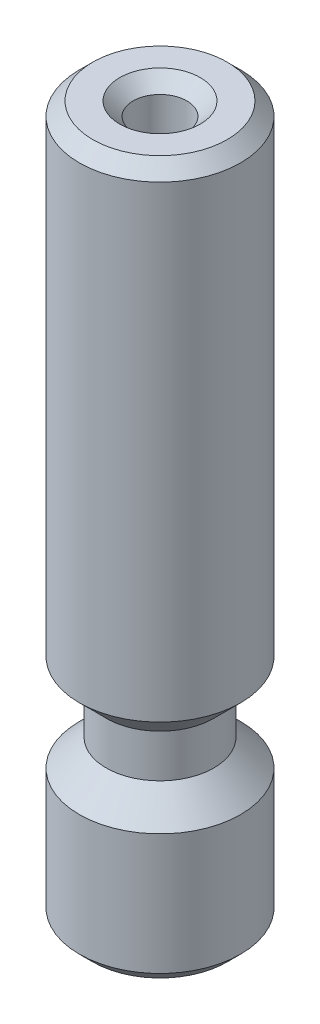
from build123d import *

# Parameters (mm, degrees)
SKETCH1_R           = 3
BOSS_EXTRUDE1_DEPTH = 26.5
SKETCH3_R           = 1
CUT_EXTRUDE1_DEPTH  = 27.837473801
CHAMFER1_SIZE       = 0.5


with BuildPart() as part:
    # Sketch1 → Boss-Extrude1 (new body)
    with BuildSketch(Plane(origin=(0, 0, 0), x_dir=(1, 0, 0), z_dir=(0, 1, 0))):
        with Locations(Location((0, 0, 0), (0, 0, 270))):
            Circle(SKETCH1_R)
    extrude(amount=BOSS_EXTRUDE1_DEPTH)

    # Sketch3 → Cut-Extrude1 (cut, through all)
    with BuildSketch(Plane(origin=(0, 26.5, 0), x_dir=(1, 0, 0), z_dir=(0, 1, 0))):
        with Locations(Location((0, 0, 0), (0, 0, 270))):
            Circle(SKETCH3_R)
    extrude(amount=-CUT_EXTRUDE1_DEPTH, mode=Mode.SUBTRACT)

    # Chamfer1
    chamfer1_edges = [part.edges().sort_by_distance(p)[0] for p in [
        (0, 0, -3),
        (0, 26.5, -3),
        (0, 26.5, -1),
    ]]
    chamfer(chamfer1_edges, length=CHAMFER1_SIZE)

    # Sketch4 → Cut-Revolve1 (revolve, cut)
    with BuildSketch(Plane.XY, mode=Mode.PRIVATE) as cut_revolve1_sk:
        Polygon((3, 8.6), (2, 7.6), (2, 6), (3, 5), align=None)
    revolve(cut_revolve1_sk.sketch.rotate(Axis((0, 0, 0), (0, 1, 0)), 90), axis=Axis((0, 0, 0), (0, 1, 0)), mode=Mode.SUBTRACT)


solid = part.part
